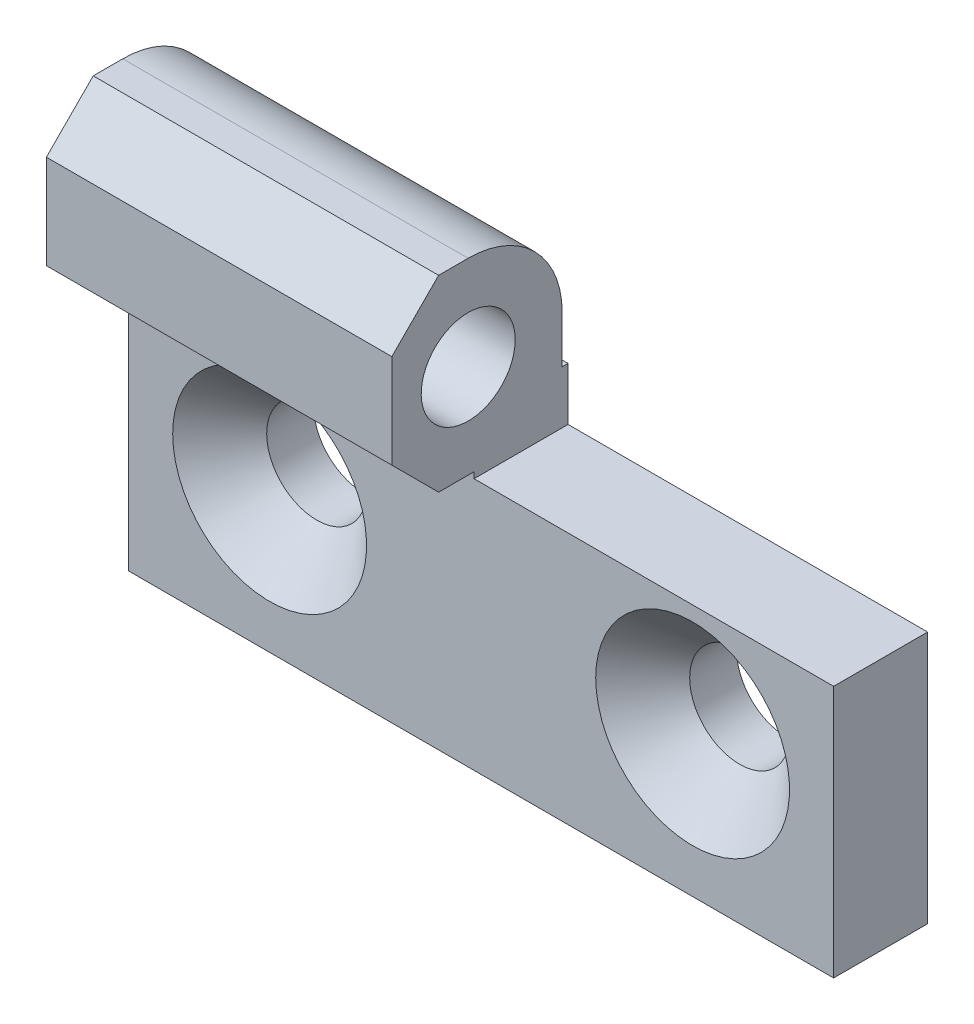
ISO-10303-21;
HEADER;
FILE_DESCRIPTION(('STEP AP214'),'2;1');
FILE_NAME('part.step','',(''),(''),'','','');
FILE_SCHEMA(('AUTOMOTIVE_DESIGN { 1 0 10303 214 1 1 1 1 }'));
ENDSEC;
DATA;
#1=APPLICATION_CONTEXT('core data for automotive mechanical design processes');
#2=APPLICATION_PROTOCOL_DEFINITION('international standard','automotive_design',2000,#1);
#3=PRODUCT_CONTEXT('',#1,'mechanical');
#4=PRODUCT('Part','Part','',(#3));
#5=PRODUCT_RELATED_PRODUCT_CATEGORY('part','',(#4));
#6=PRODUCT_DEFINITION_FORMATION('','',#4);
#7=PRODUCT_DEFINITION_CONTEXT('part definition',#1,'design');
#8=PRODUCT_DEFINITION('design','',#6,#7);
#9=PRODUCT_DEFINITION_SHAPE('','',#8);
#10=(LENGTH_UNIT() NAMED_UNIT(*) SI_UNIT(.MILLI.,.METRE.));
#11=(NAMED_UNIT(*) PLANE_ANGLE_UNIT() SI_UNIT($,.RADIAN.));
#12=(NAMED_UNIT(*) SI_UNIT($,.STERADIAN.) SOLID_ANGLE_UNIT());
#13=UNCERTAINTY_MEASURE_WITH_UNIT(LENGTH_MEASURE(1.E-05),#10,'distance_accuracy_value','');
#14=(GEOMETRIC_REPRESENTATION_CONTEXT(3) GLOBAL_UNCERTAINTY_ASSIGNED_CONTEXT((#13)) GLOBAL_UNIT_ASSIGNED_CONTEXT((#10,
#11,#12)) REPRESENTATION_CONTEXT('',''));
#15=CARTESIAN_POINT('',(0.,0.,0.));
#16=DIRECTION('',(0.,0.,1.));
#17=DIRECTION('',(1.,0.,0.));
#18=AXIS2_PLACEMENT_3D('',#15,#16,#17);
#19=CARTESIAN_POINT('',(48.,-12.,0.));
#20=DIRECTION('',(0.,0.,1.));
#21=DIRECTION('',(1.,0.,0.));
#22=AXIS2_PLACEMENT_3D('',#19,#20,#21);
#23=PLANE('',#22);
#24=CARTESIAN_POINT('',(36.,0.,0.));
#25=DIRECTION('',(0.,0.,-1.));
#26=DIRECTION('',(-1.,0.,0.));
#27=AXIS2_PLACEMENT_3D('',#24,#25,#26);
#28=CIRCLE('',#27,4.25);
#29=CARTESIAN_POINT('',(31.75,0.,0.));
#30=VERTEX_POINT('',#29);
#31=EDGE_CURVE('E171',#30,#30,#28,.T.);
#32=ORIENTED_EDGE('',*,*,#31,.F.);
#33=EDGE_LOOP('',(#32));
#34=FACE_BOUND('',#33,.T.);
#35=CARTESIAN_POINT('',(0.,0.,0.));
#36=DIRECTION('',(0.,0.,-1.));
#37=DIRECTION('',(-1.,0.,0.));
#38=AXIS2_PLACEMENT_3D('',#35,#36,#37);
#39=CIRCLE('',#38,4.25);
#40=CARTESIAN_POINT('',(-4.25,0.,0.));
#41=VERTEX_POINT('',#40);
#42=EDGE_CURVE('E162',#41,#41,#39,.T.);
#43=ORIENTED_EDGE('',*,*,#42,.F.);
#44=EDGE_LOOP('',(#43));
#45=FACE_BOUND('',#44,.T.);
#46=DIRECTION('',(-1.,0.,0.));
#47=VECTOR('',#46,1.);
#48=CARTESIAN_POINT('',(48.,9.5,0.));
#49=LINE('',#48,#47);
#50=CARTESIAN_POINT('',(48.,9.5,0.));
#51=VERTEX_POINT('',#50);
#52=CARTESIAN_POINT('',(17.4,9.5,0.));
#53=VERTEX_POINT('',#52);
#54=EDGE_CURVE('E193',#51,#53,#49,.T.);
#55=ORIENTED_EDGE('',*,*,#54,.F.);
#56=DIRECTION('',(0.,1.,0.));
#57=VECTOR('',#56,1.);
#58=CARTESIAN_POINT('',(48.,-12.,0.));
#59=LINE('',#58,#57);
#60=CARTESIAN_POINT('',(48.,-12.,0.));
#61=VERTEX_POINT('',#60);
#62=EDGE_CURVE('E154',#61,#51,#59,.T.);
#63=ORIENTED_EDGE('',*,*,#62,.F.);
#64=DIRECTION('',(-1.,0.,0.));
#65=VECTOR('',#64,1.);
#66=CARTESIAN_POINT('',(48.,-12.,0.));
#67=LINE('',#66,#65);
#68=CARTESIAN_POINT('',(-12.,-12.,0.));
#69=VERTEX_POINT('',#68);
#70=EDGE_CURVE('E150',#61,#69,#67,.T.);
#71=ORIENTED_EDGE('',*,*,#70,.T.);
#72=DIRECTION('',(0.,1.,0.));
#73=VECTOR('',#72,1.);
#74=CARTESIAN_POINT('',(-12.,-12.,0.));
#75=LINE('',#74,#73);
#76=CARTESIAN_POINT('',(-12.,14.,0.));
#77=VERTEX_POINT('',#76);
#78=EDGE_CURVE('E100',#69,#77,#75,.T.);
#79=ORIENTED_EDGE('',*,*,#78,.T.);
#80=DIRECTION('',(-1.,0.,0.));
#81=VECTOR('',#80,1.);
#82=CARTESIAN_POINT('',(48.,14.,0.));
#83=LINE('',#82,#81);
#84=CARTESIAN_POINT('',(17.4,14.,0.));
#85=VERTEX_POINT('',#84);
#86=EDGE_CURVE('E148',#85,#77,#83,.T.);
#87=ORIENTED_EDGE('',*,*,#86,.F.);
#88=DIRECTION('',(0.,1.,0.));
#89=VECTOR('',#88,1.);
#90=CARTESIAN_POINT('',(17.4,9.5,0.));
#91=LINE('',#90,#89);
#92=EDGE_CURVE('E201',#53,#85,#91,.T.);
#93=ORIENTED_EDGE('',*,*,#92,.F.);
#94=EDGE_LOOP('',(#55,#63,#71,#79,#87,#93));
#95=FACE_BOUND('',#94,.T.);
#96=ADVANCED_FACE('F14',(#34,#45,#95),#23,.F.);
#97=CARTESIAN_POINT('',(48.,10.0156402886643,8.));
#98=DIRECTION('',(0.,0.,-1.));
#99=DIRECTION('',(-1.,0.,0.));
#100=AXIS2_PLACEMENT_3D('',#97,#98,#99);
#101=PLANE('',#100);
#102=CARTESIAN_POINT('',(36.,0.,8.));
#103=DIRECTION('',(0.,0.,-1.));
#104=DIRECTION('',(-1.,0.,0.));
#105=AXIS2_PLACEMENT_3D('',#102,#103,#104);
#106=CIRCLE('',#105,8.25);
#107=CARTESIAN_POINT('',(27.75,0.,8.));
#108=VERTEX_POINT('',#107);
#109=EDGE_CURVE('E165',#108,#108,#106,.T.);
#110=ORIENTED_EDGE('',*,*,#109,.T.);
#111=EDGE_LOOP('',(#110));
#112=FACE_BOUND('',#111,.T.);
#113=CARTESIAN_POINT('',(0.,0.,8.));
#114=DIRECTION('',(0.,0.,-1.));
#115=DIRECTION('',(-1.,0.,0.));
#116=AXIS2_PLACEMENT_3D('',#113,#114,#115);
#117=CIRCLE('',#116,8.25);
#118=CARTESIAN_POINT('',(-8.25,0.,8.));
#119=VERTEX_POINT('',#118);
#120=EDGE_CURVE('E102',#119,#119,#117,.T.);
#121=ORIENTED_EDGE('',*,*,#120,.T.);
#122=EDGE_LOOP('',(#121));
#123=FACE_BOUND('',#122,.T.);
#124=DIRECTION('',(1.,0.,0.));
#125=VECTOR('',#124,1.);
#126=CARTESIAN_POINT('',(48.,9.5,8.));
#127=LINE('',#126,#125);
#128=CARTESIAN_POINT('',(17.4,9.5,8.));
#129=VERTEX_POINT('',#128);
#130=CARTESIAN_POINT('',(48.,9.5,8.));
#131=VERTEX_POINT('',#130);
#132=EDGE_CURVE('E29',#129,#131,#127,.T.);
#133=ORIENTED_EDGE('',*,*,#132,.F.);
#134=DIRECTION('',(0.,-1.,0.));
#135=VECTOR('',#134,1.);
#136=CARTESIAN_POINT('',(17.4,10.0156402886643,8.));
#137=LINE('',#136,#135);
#138=CARTESIAN_POINT('',(17.4,10.0156402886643,8.));
#139=VERTEX_POINT('',#138);
#140=EDGE_CURVE('E186',#139,#129,#137,.T.);
#141=ORIENTED_EDGE('',*,*,#140,.F.);
#142=DIRECTION('',(-1.,0.,0.));
#143=VECTOR('',#142,1.);
#144=CARTESIAN_POINT('',(48.,10.0156402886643,8.));
#145=LINE('',#144,#143);
#146=CARTESIAN_POINT('',(-12.,10.0156402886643,8.));
#147=VERTEX_POINT('',#146);
#148=EDGE_CURVE('E84',#139,#147,#145,.T.);
#149=ORIENTED_EDGE('',*,*,#148,.T.);
#150=DIRECTION('',(0.,-1.,0.));
#151=VECTOR('',#150,1.);
#152=CARTESIAN_POINT('',(-12.,10.0156402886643,8.));
#153=LINE('',#152,#151);
#154=CARTESIAN_POINT('',(-12.,-12.,8.));
#155=VERTEX_POINT('',#154);
#156=EDGE_CURVE('E77',#147,#155,#153,.T.);
#157=ORIENTED_EDGE('',*,*,#156,.T.);
#158=DIRECTION('',(-1.,0.,0.));
#159=VECTOR('',#158,1.);
#160=CARTESIAN_POINT('',(48.,-12.,8.));
#161=LINE('',#160,#159);
#162=CARTESIAN_POINT('',(48.,-12.,8.));
#163=VERTEX_POINT('',#162);
#164=EDGE_CURVE('E80',#163,#155,#161,.T.);
#165=ORIENTED_EDGE('',*,*,#164,.F.);
#166=DIRECTION('',(0.,-1.,0.));
#167=VECTOR('',#166,1.);
#168=CARTESIAN_POINT('',(48.,10.0156402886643,8.));
#169=LINE('',#168,#167);
#170=EDGE_CURVE('E37',#131,#163,#169,.T.);
#171=ORIENTED_EDGE('',*,*,#170,.F.);
#172=EDGE_LOOP('',(#133,#141,#149,#157,#165,#171));
#173=FACE_BOUND('',#172,.T.);
#174=ADVANCED_FACE('F79',(#112,#123,#173),#101,.F.);
#175=CARTESIAN_POINT('',(48.,14.,0.));
#176=DIRECTION('',(0.,-1.,0.));
#177=DIRECTION('',(1.,0.,0.));
#178=AXIS2_PLACEMENT_3D('',#175,#176,#177);
#179=PLANE('',#178);
#180=DIRECTION('',(0.,0.,1.));
#181=VECTOR('',#180,1.);
#182=CARTESIAN_POINT('',(17.4,14.,0.));
#183=LINE('',#182,#181);
#184=CARTESIAN_POINT('',(17.4,14.,0.5));
#185=VERTEX_POINT('',#184);
#186=EDGE_CURVE('E174',#85,#185,#183,.T.);
#187=ORIENTED_EDGE('',*,*,#186,.F.);
#188=ORIENTED_EDGE('',*,*,#86,.T.);
#189=DIRECTION('',(0.,0.,1.));
#190=VECTOR('',#189,1.);
#191=CARTESIAN_POINT('',(-12.,14.,0.));
#192=LINE('',#191,#190);
#193=CARTESIAN_POINT('',(-12.,14.,0.5));
#194=VERTEX_POINT('',#193);
#195=EDGE_CURVE('E104',#77,#194,#192,.T.);
#196=ORIENTED_EDGE('',*,*,#195,.T.);
#197=DIRECTION('',(-1.,0.,0.));
#198=VECTOR('',#197,1.);
#199=CARTESIAN_POINT('',(48.,14.,0.5));
#200=LINE('',#199,#198);
#201=EDGE_CURVE('E146',#185,#194,#200,.T.);
#202=ORIENTED_EDGE('',*,*,#201,.F.);
#203=EDGE_LOOP('',(#187,#188,#196,#202));
#204=FACE_BOUND('',#203,.T.);
#205=ADVANCED_FACE('F240',(#204),#179,.F.);
#206=CARTESIAN_POINT('',(48.,14.,0.5));
#207=DIRECTION('',(0.,0.,1.));
#208=DIRECTION('',(1.,0.,0.));
#209=AXIS2_PLACEMENT_3D('',#206,#207,#208);
#210=PLANE('',#209);
#211=DIRECTION('',(0.,1.,0.));
#212=VECTOR('',#211,1.);
#213=CARTESIAN_POINT('',(17.4,14.,0.5));
#214=LINE('',#213,#212);
#215=CARTESIAN_POINT('',(17.4,18.,0.5));
#216=VERTEX_POINT('',#215);
#217=EDGE_CURVE('E177',#185,#216,#214,.T.);
#218=ORIENTED_EDGE('',*,*,#217,.F.);
#219=ORIENTED_EDGE('',*,*,#201,.T.);
#220=DIRECTION('',(0.,1.,0.));
#221=VECTOR('',#220,1.);
#222=CARTESIAN_POINT('',(-12.,14.,0.5));
#223=LINE('',#222,#221);
#224=CARTESIAN_POINT('',(-12.,18.,0.5));
#225=VERTEX_POINT('',#224);
#226=EDGE_CURVE('E114',#194,#225,#223,.T.);
#227=ORIENTED_EDGE('',*,*,#226,.T.);
#228=DIRECTION('',(-1.,0.,0.));
#229=VECTOR('',#228,1.);
#230=CARTESIAN_POINT('',(48.,18.,0.5));
#231=LINE('',#230,#229);
#232=EDGE_CURVE('E144',#216,#225,#231,.T.);
#233=ORIENTED_EDGE('',*,*,#232,.F.);
#234=EDGE_LOOP('',(#218,#219,#227,#233));
#235=FACE_BOUND('',#234,.T.);
#236=ADVANCED_FACE('F239',(#235),#210,.F.);
#237=CARTESIAN_POINT('',(48.,18.,8.5));
#238=DIRECTION('',(-1.,0.,0.));
#239=DIRECTION('',(0.,-1.,0.));
#240=AXIS2_PLACEMENT_3D('',#237,#238,#239);
#241=CYLINDRICAL_SURFACE('',#240,8.);
#242=CARTESIAN_POINT('',(17.4,18.,8.5));
#243=DIRECTION('',(1.,0.,0.));
#244=DIRECTION('',(0.,1.,0.));
#245=AXIS2_PLACEMENT_3D('',#242,#243,#244);
#246=CIRCLE('',#245,8.);
#247=CARTESIAN_POINT('',(17.4,26.,8.5));
#248=VERTEX_POINT('',#247);
#249=EDGE_CURVE('E180',#216,#248,#246,.T.);
#250=ORIENTED_EDGE('',*,*,#249,.F.);
#251=ORIENTED_EDGE('',*,*,#232,.T.);
#252=CARTESIAN_POINT('',(-12.,18.,8.5));
#253=DIRECTION('',(1.,0.,0.));
#254=DIRECTION('',(0.,1.,0.));
#255=AXIS2_PLACEMENT_3D('',#252,#253,#254);
#256=CIRCLE('',#255,8.);
#257=CARTESIAN_POINT('',(-12.,26.,8.5));
#258=VERTEX_POINT('',#257);
#259=EDGE_CURVE('E117',#225,#258,#256,.T.);
#260=ORIENTED_EDGE('',*,*,#259,.T.);
#261=DIRECTION('',(-1.,0.,0.));
#262=VECTOR('',#261,1.);
#263=CARTESIAN_POINT('',(48.,26.,8.5));
#264=LINE('',#263,#262);
#265=EDGE_CURVE('E142',#248,#258,#264,.T.);
#266=ORIENTED_EDGE('',*,*,#265,.F.);
#267=EDGE_LOOP('',(#250,#251,#260,#266));
#268=FACE_BOUND('',#267,.T.);
#269=ADVANCED_FACE('F247',(#268),#241,.T.);
#270=CARTESIAN_POINT('',(48.,26.,8.5));
#271=DIRECTION('',(0.,-1.,0.));
#272=DIRECTION('',(1.,0.,0.));
#273=AXIS2_PLACEMENT_3D('',#270,#271,#272);
#274=PLANE('',#273);
#275=DIRECTION('',(0.,0.,1.));
#276=VECTOR('',#275,1.);
#277=CARTESIAN_POINT('',(17.4,26.,0.));
#278=LINE('',#277,#276);
#279=CARTESIAN_POINT('',(17.4,26.,11.0156402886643));
#280=VERTEX_POINT('',#279);
#281=EDGE_CURVE('E198',#248,#280,#278,.T.);
#282=ORIENTED_EDGE('',*,*,#281,.F.);
#283=ORIENTED_EDGE('',*,*,#265,.T.);
#284=DIRECTION('',(0.,0.,1.));
#285=VECTOR('',#284,1.);
#286=CARTESIAN_POINT('',(-12.,26.,8.5));
#287=LINE('',#286,#285);
#288=CARTESIAN_POINT('',(-12.,26.,11.0156402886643));
#289=VERTEX_POINT('',#288);
#290=EDGE_CURVE('E120',#258,#289,#287,.T.);
#291=ORIENTED_EDGE('',*,*,#290,.T.);
#292=DIRECTION('',(-1.,0.,0.));
#293=VECTOR('',#292,1.);
#294=CARTESIAN_POINT('',(48.,26.,11.0156402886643));
#295=LINE('',#294,#293);
#296=EDGE_CURVE('E140',#280,#289,#295,.T.);
#297=ORIENTED_EDGE('',*,*,#296,.F.);
#298=EDGE_LOOP('',(#282,#283,#291,#297));
#299=FACE_BOUND('',#298,.T.);
#300=ADVANCED_FACE('F258',(#299),#274,.F.);
#301=CARTESIAN_POINT('',(48.,26.,11.0156402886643));
#302=DIRECTION('',(0.,-0.705720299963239,-0.708490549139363));
#303=DIRECTION('',(0.,0.708490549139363,-0.705720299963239));
#304=AXIS2_PLACEMENT_3D('',#301,#302,#303);
#305=PLANE('',#304);
#306=DIRECTION('',(0.,-0.708490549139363,0.705720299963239));
#307=VECTOR('',#306,1.);
#308=CARTESIAN_POINT('',(17.4,26.,11.0156402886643));
#309=LINE('',#308,#307);
#310=CARTESIAN_POINT('',(17.4,22.,15.));
#311=VERTEX_POINT('',#310);
#312=EDGE_CURVE('E183',#280,#311,#309,.T.);
#313=ORIENTED_EDGE('',*,*,#312,.F.);
#314=ORIENTED_EDGE('',*,*,#296,.T.);
#315=DIRECTION('',(0.,-0.708490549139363,0.705720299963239));
#316=VECTOR('',#315,1.);
#317=CARTESIAN_POINT('',(-12.,26.,11.0156402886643));
#318=LINE('',#317,#316);
#319=CARTESIAN_POINT('',(-12.,22.,15.));
#320=VERTEX_POINT('',#319);
#321=EDGE_CURVE('E123',#289,#320,#318,.T.);
#322=ORIENTED_EDGE('',*,*,#321,.T.);
#323=DIRECTION('',(-1.,0.,0.));
#324=VECTOR('',#323,1.);
#325=CARTESIAN_POINT('',(48.,22.,15.));
#326=LINE('',#325,#324);
#327=EDGE_CURVE('E138',#311,#320,#326,.T.);
#328=ORIENTED_EDGE('',*,*,#327,.F.);
#329=EDGE_LOOP('',(#313,#314,#322,#328));
#330=FACE_BOUND('',#329,.T.);
#331=ADVANCED_FACE('F261',(#330),#305,.F.);
#332=CARTESIAN_POINT('',(48.,22.,15.));
#333=DIRECTION('',(0.,0.,-1.));
#334=DIRECTION('',(-1.,0.,0.));
#335=AXIS2_PLACEMENT_3D('',#332,#333,#334);
#336=PLANE('',#335);
#337=DIRECTION('',(0.,-1.,0.));
#338=VECTOR('',#337,1.);
#339=CARTESIAN_POINT('',(17.4,26.,15.));
#340=LINE('',#339,#338);
#341=CARTESIAN_POINT('',(17.4,14.,15.));
#342=VERTEX_POINT('',#341);
#343=EDGE_CURVE('E195',#311,#342,#340,.T.);
#344=ORIENTED_EDGE('',*,*,#343,.F.);
#345=ORIENTED_EDGE('',*,*,#327,.T.);
#346=DIRECTION('',(0.,-1.,0.));
#347=VECTOR('',#346,1.);
#348=CARTESIAN_POINT('',(-12.,22.,15.));
#349=LINE('',#348,#347);
#350=CARTESIAN_POINT('',(-12.,14.,15.));
#351=VERTEX_POINT('',#350);
#352=EDGE_CURVE('E126',#320,#351,#349,.T.);
#353=ORIENTED_EDGE('',*,*,#352,.T.);
#354=DIRECTION('',(-1.,0.,0.));
#355=VECTOR('',#354,1.);
#356=CARTESIAN_POINT('',(48.,14.,15.));
#357=LINE('',#356,#355);
#358=EDGE_CURVE('E136',#342,#351,#357,.T.);
#359=ORIENTED_EDGE('',*,*,#358,.F.);
#360=EDGE_LOOP('',(#344,#345,#353,#359));
#361=FACE_BOUND('',#360,.T.);
#362=ADVANCED_FACE('F270',(#361),#336,.F.);
#363=CARTESIAN_POINT('',(48.,14.,15.));
#364=DIRECTION('',(0.,0.707106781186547,-0.707106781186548));
#365=DIRECTION('',(0.,0.707106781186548,0.707106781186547));
#366=AXIS2_PLACEMENT_3D('',#363,#364,#365);
#367=PLANE('',#366);
#368=DIRECTION('',(0.,-0.707106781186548,-0.707106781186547));
#369=VECTOR('',#368,1.);
#370=CARTESIAN_POINT('',(17.4,14.,15.));
#371=LINE('',#370,#369);
#372=CARTESIAN_POINT('',(17.4,10.0156402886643,11.0156402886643));
#373=VERTEX_POINT('',#372);
#374=EDGE_CURVE('E189',#342,#373,#371,.T.);
#375=ORIENTED_EDGE('',*,*,#374,.F.);
#376=ORIENTED_EDGE('',*,*,#358,.T.);
#377=DIRECTION('',(0.,-0.707106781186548,-0.707106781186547));
#378=VECTOR('',#377,1.);
#379=CARTESIAN_POINT('',(-12.,14.,15.));
#380=LINE('',#379,#378);
#381=CARTESIAN_POINT('',(-12.,10.0156402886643,11.0156402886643));
#382=VERTEX_POINT('',#381);
#383=EDGE_CURVE('E129',#351,#382,#380,.T.);
#384=ORIENTED_EDGE('',*,*,#383,.T.);
#385=DIRECTION('',(-1.,0.,0.));
#386=VECTOR('',#385,1.);
#387=CARTESIAN_POINT('',(48.,10.0156402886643,11.0156402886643));
#388=LINE('',#387,#386);
#389=EDGE_CURVE('E134',#373,#382,#388,.T.);
#390=ORIENTED_EDGE('',*,*,#389,.F.);
#391=EDGE_LOOP('',(#375,#376,#384,#390));
#392=FACE_BOUND('',#391,.T.);
#393=ADVANCED_FACE('F274',(#392),#367,.F.);
#394=CARTESIAN_POINT('',(48.,10.0156402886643,11.0156402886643));
#395=DIRECTION('',(0.,1.,0.));
#396=DIRECTION('',(-1.,0.,0.));
#397=AXIS2_PLACEMENT_3D('',#394,#395,#396);
#398=PLANE('',#397);
#399=DIRECTION('',(0.,0.,-1.));
#400=VECTOR('',#399,1.);
#401=CARTESIAN_POINT('',(17.4,10.0156402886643,11.0156402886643));
#402=LINE('',#401,#400);
#403=EDGE_CURVE('E9',#373,#139,#402,.T.);
#404=ORIENTED_EDGE('',*,*,#403,.F.);
#405=ORIENTED_EDGE('',*,*,#389,.T.);
#406=DIRECTION('',(0.,0.,-1.));
#407=VECTOR('',#406,1.);
#408=CARTESIAN_POINT('',(-12.,10.0156402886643,11.0156402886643));
#409=LINE('',#408,#407);
#410=EDGE_CURVE('E90',#382,#147,#409,.T.);
#411=ORIENTED_EDGE('',*,*,#410,.T.);
#412=ORIENTED_EDGE('',*,*,#148,.F.);
#413=EDGE_LOOP('',(#404,#405,#411,#412));
#414=FACE_BOUND('',#413,.T.);
#415=ADVANCED_FACE('F280',(#414),#398,.F.);
#416=CARTESIAN_POINT('',(48.,18.,8.5));
#417=DIRECTION('',(1.,0.,0.));
#418=DIRECTION('',(0.,1.,0.));
#419=AXIS2_PLACEMENT_3D('',#416,#417,#418);
#420=PLANE('',#419);
#421=ORIENTED_EDGE('',*,*,#62,.T.);
#422=DIRECTION('',(0.,0.,1.));
#423=VECTOR('',#422,1.);
#424=CARTESIAN_POINT('',(48.,9.5,8.5));
#425=LINE('',#424,#423);
#426=EDGE_CURVE('E22',#51,#131,#425,.T.);
#427=ORIENTED_EDGE('',*,*,#426,.T.);
#428=ORIENTED_EDGE('',*,*,#170,.T.);
#429=DIRECTION('',(0.,0.,-1.));
#430=VECTOR('',#429,1.);
#431=CARTESIAN_POINT('',(48.,-12.,8.));
#432=LINE('',#431,#430);
#433=EDGE_CURVE('E89',#163,#61,#432,.T.);
#434=ORIENTED_EDGE('',*,*,#433,.T.);
#435=EDGE_LOOP('',(#421,#427,#428,#434));
#436=FACE_BOUND('',#435,.T.);
#437=ADVANCED_FACE('F152',(#436),#420,.T.);
#438=CARTESIAN_POINT('',(48.,-12.,8.));
#439=DIRECTION('',(0.,1.,0.));
#440=DIRECTION('',(-1.,0.,0.));
#441=AXIS2_PLACEMENT_3D('',#438,#439,#440);
#442=PLANE('',#441);
#443=DIRECTION('',(0.,0.,-1.));
#444=VECTOR('',#443,1.);
#445=CARTESIAN_POINT('',(-12.,-12.,8.));
#446=LINE('',#445,#444);
#447=EDGE_CURVE('E95',#155,#69,#446,.T.);
#448=ORIENTED_EDGE('',*,*,#447,.T.);
#449=ORIENTED_EDGE('',*,*,#70,.F.);
#450=ORIENTED_EDGE('',*,*,#433,.F.);
#451=ORIENTED_EDGE('',*,*,#164,.T.);
#452=EDGE_LOOP('',(#448,#449,#450,#451));
#453=FACE_BOUND('',#452,.T.);
#454=ADVANCED_FACE('F16',(#453),#442,.F.);
#455=CARTESIAN_POINT('',(-12.,18.,8.5));
#456=DIRECTION('',(1.,0.,0.));
#457=DIRECTION('',(0.,1.,0.));
#458=AXIS2_PLACEMENT_3D('',#455,#456,#457);
#459=PLANE('',#458);
#460=ORIENTED_EDGE('',*,*,#447,.F.);
#461=ORIENTED_EDGE('',*,*,#156,.F.);
#462=ORIENTED_EDGE('',*,*,#410,.F.);
#463=ORIENTED_EDGE('',*,*,#383,.F.);
#464=ORIENTED_EDGE('',*,*,#352,.F.);
#465=ORIENTED_EDGE('',*,*,#321,.F.);
#466=ORIENTED_EDGE('',*,*,#290,.F.);
#467=ORIENTED_EDGE('',*,*,#259,.F.);
#468=ORIENTED_EDGE('',*,*,#226,.F.);
#469=ORIENTED_EDGE('',*,*,#195,.F.);
#470=ORIENTED_EDGE('',*,*,#78,.F.);
#471=EDGE_LOOP('',(#460,#461,#462,#463,#464,#465,#466,#467,#468,#469,#470));
#472=FACE_BOUND('',#471,.T.);
#473=ADVANCED_FACE('F97',(#472),#459,.F.);
#474=CARTESIAN_POINT('',(0.,0.,8.));
#475=DIRECTION('',(0.,0.,1.));
#476=DIRECTION('',(1.,0.,0.));
#477=AXIS2_PLACEMENT_3D('',#474,#475,#476);
#478=CONICAL_SURFACE('',#477,8.25,0.785398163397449);
#479=CARTESIAN_POINT('',(0.,0.,4.));
#480=DIRECTION('',(0.,0.,-1.));
#481=DIRECTION('',(-1.,0.,0.));
#482=AXIS2_PLACEMENT_3D('',#479,#480,#481);
#483=CIRCLE('',#482,4.25);
#484=CARTESIAN_POINT('',(-4.25,0.,4.));
#485=VERTEX_POINT('',#484);
#486=EDGE_CURVE('E107',#485,#485,#483,.T.);
#487=ORIENTED_EDGE('',*,*,#486,.T.);
#488=EDGE_LOOP('',(#487));
#489=FACE_BOUND('',#488,.T.);
#490=ORIENTED_EDGE('',*,*,#120,.F.);
#491=EDGE_LOOP('',(#490));
#492=FACE_BOUND('',#491,.T.);
#493=ADVANCED_FACE('F318',(#489,#492),#478,.F.);
#494=CARTESIAN_POINT('',(0.,0.,-50.));
#495=DIRECTION('',(0.,0.,-1.));
#496=DIRECTION('',(-1.,0.,0.));
#497=AXIS2_PLACEMENT_3D('',#494,#495,#496);
#498=CYLINDRICAL_SURFACE('',#497,4.25);
#499=ORIENTED_EDGE('',*,*,#42,.T.);
#500=EDGE_LOOP('',(#499));
#501=FACE_BOUND('',#500,.T.);
#502=ORIENTED_EDGE('',*,*,#486,.F.);
#503=EDGE_LOOP('',(#502));
#504=FACE_BOUND('',#503,.T.);
#505=ADVANCED_FACE('F323',(#501,#504),#498,.F.);
#506=CARTESIAN_POINT('',(36.,0.,8.));
#507=DIRECTION('',(0.,0.,1.));
#508=DIRECTION('',(1.,0.,0.));
#509=AXIS2_PLACEMENT_3D('',#506,#507,#508);
#510=CONICAL_SURFACE('',#509,8.25,0.785398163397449);
#511=CARTESIAN_POINT('',(36.,0.,4.));
#512=DIRECTION('',(0.,0.,-1.));
#513=DIRECTION('',(-1.,0.,0.));
#514=AXIS2_PLACEMENT_3D('',#511,#512,#513);
#515=CIRCLE('',#514,4.25);
#516=CARTESIAN_POINT('',(31.75,0.,4.));
#517=VERTEX_POINT('',#516);
#518=EDGE_CURVE('E168',#517,#517,#515,.T.);
#519=ORIENTED_EDGE('',*,*,#518,.T.);
#520=EDGE_LOOP('',(#519));
#521=FACE_BOUND('',#520,.T.);
#522=ORIENTED_EDGE('',*,*,#109,.F.);
#523=EDGE_LOOP('',(#522));
#524=FACE_BOUND('',#523,.T.);
#525=ADVANCED_FACE('F327',(#521,#524),#510,.F.);
#526=CARTESIAN_POINT('',(36.,0.,-50.));
#527=DIRECTION('',(0.,0.,-1.));
#528=DIRECTION('',(-1.,0.,0.));
#529=AXIS2_PLACEMENT_3D('',#526,#527,#528);
#530=CYLINDRICAL_SURFACE('',#529,4.25);
#531=ORIENTED_EDGE('',*,*,#31,.T.);
#532=EDGE_LOOP('',(#531));
#533=FACE_BOUND('',#532,.T.);
#534=ORIENTED_EDGE('',*,*,#518,.F.);
#535=EDGE_LOOP('',(#534));
#536=FACE_BOUND('',#535,.T.);
#537=ADVANCED_FACE('F226',(#533,#536),#530,.F.);
#538=CARTESIAN_POINT('',(17.4,-12.,0.));
#539=DIRECTION('',(1.,0.,0.));
#540=DIRECTION('',(0.,1.,0.));
#541=AXIS2_PLACEMENT_3D('',#538,#539,#540);
#542=PLANE('',#541);
#543=CARTESIAN_POINT('',(17.4,18.,8.5));
#544=DIRECTION('',(1.,0.,0.));
#545=DIRECTION('',(0.,1.,0.));
#546=AXIS2_PLACEMENT_3D('',#543,#544,#545);
#547=CIRCLE('',#546,4.);
#548=CARTESIAN_POINT('',(17.4,22.,8.5));
#549=VERTEX_POINT('',#548);
#550=EDGE_CURVE('E208',#549,#549,#547,.T.);
#551=ORIENTED_EDGE('',*,*,#550,.F.);
#552=EDGE_LOOP('',(#551));
#553=FACE_BOUND('',#552,.T.);
#554=ORIENTED_EDGE('',*,*,#186,.T.);
#555=ORIENTED_EDGE('',*,*,#217,.T.);
#556=ORIENTED_EDGE('',*,*,#249,.T.);
#557=ORIENTED_EDGE('',*,*,#281,.T.);
#558=ORIENTED_EDGE('',*,*,#312,.T.);
#559=ORIENTED_EDGE('',*,*,#343,.T.);
#560=ORIENTED_EDGE('',*,*,#374,.T.);
#561=ORIENTED_EDGE('',*,*,#403,.T.);
#562=ORIENTED_EDGE('',*,*,#140,.T.);
#563=DIRECTION('',(0.,0.,-1.));
#564=VECTOR('',#563,1.);
#565=CARTESIAN_POINT('',(17.4,9.5,15.));
#566=LINE('',#565,#564);
#567=EDGE_CURVE('E204',#129,#53,#566,.T.);
#568=ORIENTED_EDGE('',*,*,#567,.T.);
#569=ORIENTED_EDGE('',*,*,#92,.T.);
#570=EDGE_LOOP('',(#554,#555,#556,#557,#558,#559,#560,#561,#562,#568,#569));
#571=FACE_BOUND('',#570,.T.);
#572=ADVANCED_FACE('F223',(#553,#571),#542,.T.);
#573=CARTESIAN_POINT('',(48.,9.5,15.));
#574=DIRECTION('',(0.,1.,0.));
#575=DIRECTION('',(-1.,0.,0.));
#576=AXIS2_PLACEMENT_3D('',#573,#574,#575);
#577=PLANE('',#576);
#578=ORIENTED_EDGE('',*,*,#132,.T.);
#579=ORIENTED_EDGE('',*,*,#426,.F.);
#580=ORIENTED_EDGE('',*,*,#54,.T.);
#581=ORIENTED_EDGE('',*,*,#567,.F.);
#582=EDGE_LOOP('',(#578,#579,#580,#581));
#583=FACE_BOUND('',#582,.T.);
#584=ADVANCED_FACE('F219',(#583),#577,.T.);
#585=CARTESIAN_POINT('',(3.36,18.,8.5));
#586=DIRECTION('',(1.,0.,0.));
#587=DIRECTION('',(0.,1.,0.));
#588=AXIS2_PLACEMENT_3D('',#585,#586,#587);
#589=CYLINDRICAL_SURFACE('',#588,4.);
#590=CARTESIAN_POINT('',(3.36,18.,8.5));
#591=DIRECTION('',(1.,0.,0.));
#592=DIRECTION('',(0.,1.,0.));
#593=AXIS2_PLACEMENT_3D('',#590,#591,#592);
#594=CIRCLE('',#593,4.);
#595=CARTESIAN_POINT('',(3.36,22.,8.5));
#596=VERTEX_POINT('',#595);
#597=EDGE_CURVE('E207',#596,#596,#594,.T.);
#598=ORIENTED_EDGE('',*,*,#597,.F.);
#599=EDGE_LOOP('',(#598));
#600=FACE_BOUND('',#599,.T.);
#601=ORIENTED_EDGE('',*,*,#550,.T.);
#602=EDGE_LOOP('',(#601));
#603=FACE_BOUND('',#602,.T.);
#604=ADVANCED_FACE('F216',(#600,#603),#589,.F.);
#605=CARTESIAN_POINT('',(3.36,18.,8.5));
#606=DIRECTION('',(1.,0.,0.));
#607=DIRECTION('',(0.,1.,0.));
#608=AXIS2_PLACEMENT_3D('',#605,#606,#607);
#609=PLANE('',#608);
#610=ORIENTED_EDGE('',*,*,#597,.T.);
#611=EDGE_LOOP('',(#610));
#612=FACE_BOUND('',#611,.T.);
#613=ADVANCED_FACE('F214',(#612),#609,.T.);
#614=CLOSED_SHELL('',(#96,#174,#205,#236,#269,#300,#331,#362,#393,#415,#437,#454,#473,#493,#505,
#525,#537,#572,#584,#604,#613));
#615=MANIFOLD_SOLID_BREP('B1',#614);
#616=ADVANCED_BREP_SHAPE_REPRESENTATION('',(#18,#615),#14);
#617=SHAPE_DEFINITION_REPRESENTATION(#9,#616);
ENDSEC;
END-ISO-10303-21;
